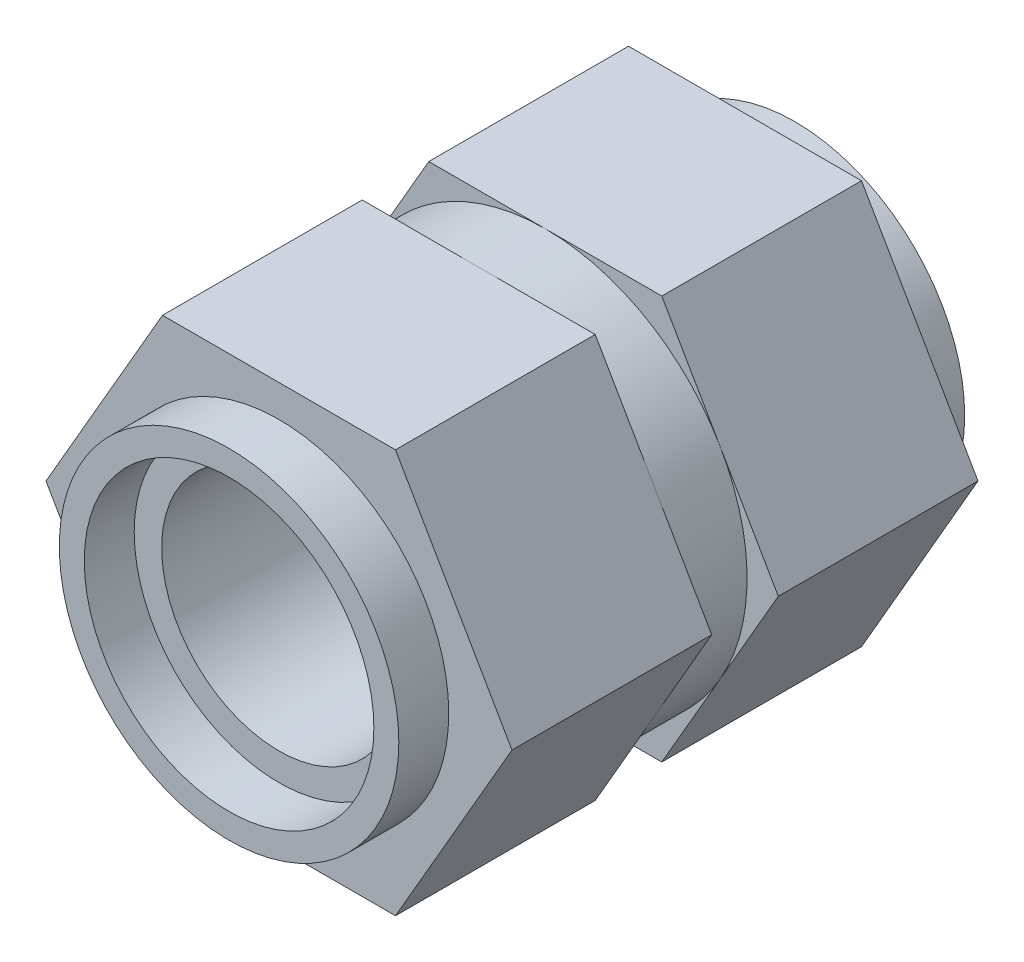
ISO-10303-21;
HEADER;
FILE_DESCRIPTION(('STEP AP214'),'2;1');
FILE_NAME('part.step','',(''),(''),'','','');
FILE_SCHEMA(('AUTOMOTIVE_DESIGN { 1 0 10303 214 1 1 1 1 }'));
ENDSEC;
DATA;
#1=APPLICATION_CONTEXT('core data for automotive mechanical design processes');
#2=APPLICATION_PROTOCOL_DEFINITION('international standard','automotive_design',2000,#1);
#3=PRODUCT_CONTEXT('',#1,'mechanical');
#4=PRODUCT('Part','Part','',(#3));
#5=PRODUCT_RELATED_PRODUCT_CATEGORY('part','',(#4));
#6=PRODUCT_DEFINITION_FORMATION('','',#4);
#7=PRODUCT_DEFINITION_CONTEXT('part definition',#1,'design');
#8=PRODUCT_DEFINITION('design','',#6,#7);
#9=PRODUCT_DEFINITION_SHAPE('','',#8);
#10=(LENGTH_UNIT() NAMED_UNIT(*) SI_UNIT(.MILLI.,.METRE.));
#11=(NAMED_UNIT(*) PLANE_ANGLE_UNIT() SI_UNIT($,.RADIAN.));
#12=(NAMED_UNIT(*) SI_UNIT($,.STERADIAN.) SOLID_ANGLE_UNIT());
#13=UNCERTAINTY_MEASURE_WITH_UNIT(LENGTH_MEASURE(1.E-05),#10,'distance_accuracy_value','');
#14=(GEOMETRIC_REPRESENTATION_CONTEXT(3) GLOBAL_UNCERTAINTY_ASSIGNED_CONTEXT((#13)) GLOBAL_UNIT_ASSIGNED_CONTEXT((#10,
#11,#12)) REPRESENTATION_CONTEXT('',''));
#15=CARTESIAN_POINT('',(0.,0.,0.));
#16=DIRECTION('',(0.,0.,1.));
#17=DIRECTION('',(1.,0.,0.));
#18=AXIS2_PLACEMENT_3D('',#15,#16,#17);
#19=CARTESIAN_POINT('',(0.,0.,14.));
#20=DIRECTION('',(0.,0.,1.));
#21=DIRECTION('',(1.,0.,0.));
#22=AXIS2_PLACEMENT_3D('',#19,#20,#21);
#23=PLANE('',#22);
#24=DIRECTION('',(0.499999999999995,0.866025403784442,0.));
#25=VECTOR('',#24,1.);
#26=CARTESIAN_POINT('',(3.50000000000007,-6.06217782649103,14.));
#27=LINE('',#26,#25);
#28=CARTESIAN_POINT('',(3.50000000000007,-6.06217782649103,14.));
#29=VERTEX_POINT('',#28);
#30=CARTESIAN_POINT('',(7.,0.,14.));
#31=VERTEX_POINT('',#30);
#32=EDGE_CURVE('E168',#29,#31,#27,.T.);
#33=ORIENTED_EDGE('',*,*,#32,.T.);
#34=DIRECTION('',(-0.500000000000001,0.866025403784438,0.));
#35=VECTOR('',#34,1.);
#36=CARTESIAN_POINT('',(7.,0.,14.));
#37=LINE('',#36,#35);
#38=CARTESIAN_POINT('',(3.49999999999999,6.06217782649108,14.));
#39=VERTEX_POINT('',#38);
#40=EDGE_CURVE('E157',#31,#39,#37,.T.);
#41=ORIENTED_EDGE('',*,*,#40,.T.);
#42=DIRECTION('',(-1.,0.,0.));
#43=VECTOR('',#42,1.);
#44=CARTESIAN_POINT('',(3.49999999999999,6.06217782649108,14.));
#45=LINE('',#44,#43);
#46=CARTESIAN_POINT('',(-3.50000000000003,6.06217782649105,14.));
#47=VERTEX_POINT('',#46);
#48=EDGE_CURVE('E167',#39,#47,#45,.T.);
#49=ORIENTED_EDGE('',*,*,#48,.T.);
#50=DIRECTION('',(-0.499999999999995,-0.866025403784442,0.));
#51=VECTOR('',#50,1.);
#52=CARTESIAN_POINT('',(-3.50000000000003,6.06217782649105,14.));
#53=LINE('',#52,#51);
#54=CARTESIAN_POINT('',(-7.,0.,14.));
#55=VERTEX_POINT('',#54);
#56=EDGE_CURVE('E359',#47,#55,#53,.T.);
#57=ORIENTED_EDGE('',*,*,#56,.T.);
#58=DIRECTION('',(0.500000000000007,-0.866025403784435,0.));
#59=VECTOR('',#58,1.);
#60=CARTESIAN_POINT('',(-7.,0.,14.));
#61=LINE('',#60,#59);
#62=CARTESIAN_POINT('',(-3.49999999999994,-6.0621778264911,14.));
#63=VERTEX_POINT('',#62);
#64=EDGE_CURVE('E361',#55,#63,#61,.T.);
#65=ORIENTED_EDGE('',*,*,#64,.T.);
#66=DIRECTION('',(1.,0.,0.));
#67=VECTOR('',#66,1.);
#68=CARTESIAN_POINT('',(-3.49999999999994,-6.0621778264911,14.));
#69=LINE('',#68,#67);
#70=EDGE_CURVE('E173',#63,#29,#69,.T.);
#71=ORIENTED_EDGE('',*,*,#70,.T.);
#72=EDGE_LOOP('',(#33,#41,#49,#57,#65,#71));
#73=FACE_BOUND('',#72,.T.);
#74=CARTESIAN_POINT('',(0.,0.,14.));
#75=DIRECTION('',(0.,0.,1.));
#76=DIRECTION('',(1.,0.,0.));
#77=AXIS2_PLACEMENT_3D('',#74,#75,#76);
#78=CIRCLE('',#77,5.1);
#79=CARTESIAN_POINT('',(5.1,0.,14.));
#80=VERTEX_POINT('',#79);
#81=EDGE_CURVE('E719',#80,#80,#78,.T.);
#82=ORIENTED_EDGE('',*,*,#81,.F.);
#83=EDGE_LOOP('',(#82));
#84=FACE_BOUND('',#83,.T.);
#85=ADVANCED_FACE('F34',(#73,#84),#23,.T.);
#86=CARTESIAN_POINT('',(0.,0.,0.));
#87=DIRECTION('',(0.,0.,1.));
#88=DIRECTION('',(1.,0.,0.));
#89=AXIS2_PLACEMENT_3D('',#86,#87,#88);
#90=PLANE('',#89);
#91=DIRECTION('',(0.499999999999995,0.866025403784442,0.));
#92=VECTOR('',#91,1.);
#93=CARTESIAN_POINT('',(3.50000000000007,-6.06217782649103,0.));
#94=LINE('',#93,#92);
#95=CARTESIAN_POINT('',(3.50000000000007,-6.06217782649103,0.));
#96=VERTEX_POINT('',#95);
#97=CARTESIAN_POINT('',(7.,0.,0.));
#98=VERTEX_POINT('',#97);
#99=EDGE_CURVE('E196',#96,#98,#94,.T.);
#100=ORIENTED_EDGE('',*,*,#99,.F.);
#101=DIRECTION('',(1.,0.,0.));
#102=VECTOR('',#101,1.);
#103=CARTESIAN_POINT('',(-3.49999999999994,-6.0621778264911,0.));
#104=LINE('',#103,#102);
#105=CARTESIAN_POINT('',(-3.49999999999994,-6.0621778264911,0.));
#106=VERTEX_POINT('',#105);
#107=EDGE_CURVE('E233',#106,#96,#104,.T.);
#108=ORIENTED_EDGE('',*,*,#107,.F.);
#109=DIRECTION('',(0.500000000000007,-0.866025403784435,0.));
#110=VECTOR('',#109,1.);
#111=CARTESIAN_POINT('',(-7.,0.,0.));
#112=LINE('',#111,#110);
#113=CARTESIAN_POINT('',(-7.,0.,0.));
#114=VERTEX_POINT('',#113);
#115=EDGE_CURVE('E231',#114,#106,#112,.T.);
#116=ORIENTED_EDGE('',*,*,#115,.F.);
#117=DIRECTION('',(-0.499999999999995,-0.866025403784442,0.));
#118=VECTOR('',#117,1.);
#119=CARTESIAN_POINT('',(-3.50000000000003,6.06217782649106,0.));
#120=LINE('',#119,#118);
#121=CARTESIAN_POINT('',(-3.50000000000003,6.06217782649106,0.));
#122=VERTEX_POINT('',#121);
#123=EDGE_CURVE('E229',#122,#114,#120,.T.);
#124=ORIENTED_EDGE('',*,*,#123,.F.);
#125=DIRECTION('',(-1.,0.,0.));
#126=VECTOR('',#125,1.);
#127=CARTESIAN_POINT('',(3.49999999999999,6.06217782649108,0.));
#128=LINE('',#127,#126);
#129=CARTESIAN_POINT('',(3.49999999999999,6.06217782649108,0.));
#130=VERTEX_POINT('',#129);
#131=EDGE_CURVE('E227',#130,#122,#128,.T.);
#132=ORIENTED_EDGE('',*,*,#131,.F.);
#133=DIRECTION('',(-0.500000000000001,0.866025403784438,0.));
#134=VECTOR('',#133,1.);
#135=CARTESIAN_POINT('',(7.,0.,0.));
#136=LINE('',#135,#134);
#137=EDGE_CURVE('E225',#98,#130,#136,.T.);
#138=ORIENTED_EDGE('',*,*,#137,.F.);
#139=EDGE_LOOP('',(#100,#108,#116,#124,#132,#138));
#140=FACE_BOUND('',#139,.T.);
#141=CARTESIAN_POINT('',(0.,0.,0.));
#142=DIRECTION('',(0.,0.,1.));
#143=DIRECTION('',(1.,0.,0.));
#144=AXIS2_PLACEMENT_3D('',#141,#142,#143);
#145=CIRCLE('',#144,5.1);
#146=CARTESIAN_POINT('',(5.1,0.,0.));
#147=VERTEX_POINT('',#146);
#148=EDGE_CURVE('E42',#147,#147,#145,.F.);
#149=ORIENTED_EDGE('',*,*,#148,.F.);
#150=EDGE_LOOP('',(#149));
#151=FACE_BOUND('',#150,.T.);
#152=ADVANCED_FACE('F283',(#140,#151),#90,.F.);
#153=CARTESIAN_POINT('',(0.,0.,6.));
#154=DIRECTION('',(0.,0.,1.));
#155=DIRECTION('',(1.,0.,0.));
#156=AXIS2_PLACEMENT_3D('',#153,#154,#155);
#157=PLANE('',#156);
#158=CARTESIAN_POINT('',(0.,0.,6.));
#159=DIRECTION('',(0.,0.,1.));
#160=DIRECTION('',(1.,0.,0.));
#161=AXIS2_PLACEMENT_3D('',#158,#159,#160);
#162=CIRCLE('',#161,6.06217881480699);
#163=CARTESIAN_POINT('',(5.25000085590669,3.0310894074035,6.));
#164=VERTEX_POINT('',#163);
#165=CARTESIAN_POINT('',(0.,6.06217782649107,6.));
#166=VERTEX_POINT('',#165);
#167=EDGE_CURVE('E184',#164,#166,#162,.T.);
#168=ORIENTED_EDGE('',*,*,#167,.F.);
#169=DIRECTION('',(-0.500000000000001,0.866025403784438,0.));
#170=VECTOR('',#169,1.);
#171=CARTESIAN_POINT('',(7.,0.,6.));
#172=LINE('',#171,#170);
#173=CARTESIAN_POINT('',(3.49999999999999,6.06217782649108,6.));
#174=VERTEX_POINT('',#173);
#175=EDGE_CURVE('E202',#164,#174,#172,.T.);
#176=ORIENTED_EDGE('',*,*,#175,.T.);
#177=DIRECTION('',(-1.,0.,0.));
#178=VECTOR('',#177,1.);
#179=CARTESIAN_POINT('',(3.49999999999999,6.06217782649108,6.));
#180=LINE('',#179,#178);
#181=EDGE_CURVE('E207',#174,#166,#180,.T.);
#182=ORIENTED_EDGE('',*,*,#181,.T.);
#183=EDGE_LOOP('',(#168,#176,#182));
#184=FACE_BOUND('',#183,.T.);
#185=ADVANCED_FACE('F293',(#184),#157,.T.);
#186=CARTESIAN_POINT('',(-5.25000000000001,3.0310889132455,6.));
#187=VERTEX_POINT('',#186);
#188=EDGE_CURVE('E188',#166,#187,#162,.T.);
#189=ORIENTED_EDGE('',*,*,#188,.F.);
#190=CARTESIAN_POINT('',(-3.50000000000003,6.06217782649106,6.));
#191=VERTEX_POINT('',#190);
#192=EDGE_CURVE('E206',#166,#191,#180,.T.);
#193=ORIENTED_EDGE('',*,*,#192,.T.);
#194=DIRECTION('',(-0.499999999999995,-0.866025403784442,0.));
#195=VECTOR('',#194,1.);
#196=CARTESIAN_POINT('',(-3.50000000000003,6.06217782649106,6.));
#197=LINE('',#196,#195);
#198=EDGE_CURVE('E211',#191,#187,#197,.T.);
#199=ORIENTED_EDGE('',*,*,#198,.T.);
#200=EDGE_LOOP('',(#189,#193,#199));
#201=FACE_BOUND('',#200,.T.);
#202=ADVANCED_FACE('F300',(#201),#157,.T.);
#203=CARTESIAN_POINT('',(-5.24999999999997,-3.03108891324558,6.));
#204=VERTEX_POINT('',#203);
#205=EDGE_CURVE('E255',#187,#204,#162,.T.);
#206=ORIENTED_EDGE('',*,*,#205,.F.);
#207=CARTESIAN_POINT('',(-7.,0.,6.));
#208=VERTEX_POINT('',#207);
#209=EDGE_CURVE('E210',#187,#208,#197,.T.);
#210=ORIENTED_EDGE('',*,*,#209,.T.);
#211=DIRECTION('',(0.500000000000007,-0.866025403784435,0.));
#212=VECTOR('',#211,1.);
#213=CARTESIAN_POINT('',(-7.,0.,6.));
#214=LINE('',#213,#212);
#215=EDGE_CURVE('E215',#208,#204,#214,.T.);
#216=ORIENTED_EDGE('',*,*,#215,.T.);
#217=EDGE_LOOP('',(#206,#210,#216));
#218=FACE_BOUND('',#217,.T.);
#219=ADVANCED_FACE('F307',(#218),#157,.T.);
#220=CARTESIAN_POINT('',(0.,-6.06217782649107,6.));
#221=VERTEX_POINT('',#220);
#222=EDGE_CURVE('E258',#204,#221,#162,.T.);
#223=ORIENTED_EDGE('',*,*,#222,.F.);
#224=CARTESIAN_POINT('',(-3.49999999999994,-6.0621778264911,6.));
#225=VERTEX_POINT('',#224);
#226=EDGE_CURVE('E214',#204,#225,#214,.T.);
#227=ORIENTED_EDGE('',*,*,#226,.T.);
#228=DIRECTION('',(1.,0.,0.));
#229=VECTOR('',#228,1.);
#230=CARTESIAN_POINT('',(-3.49999999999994,-6.0621778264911,6.));
#231=LINE('',#230,#229);
#232=EDGE_CURVE('E219',#225,#221,#231,.T.);
#233=ORIENTED_EDGE('',*,*,#232,.T.);
#234=EDGE_LOOP('',(#223,#227,#233));
#235=FACE_BOUND('',#234,.T.);
#236=ADVANCED_FACE('F313',(#235),#157,.T.);
#237=CARTESIAN_POINT('',(5.25000000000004,-3.03108891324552,6.));
#238=VERTEX_POINT('',#237);
#239=EDGE_CURVE('E260',#221,#238,#162,.T.);
#240=ORIENTED_EDGE('',*,*,#239,.F.);
#241=CARTESIAN_POINT('',(3.50000000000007,-6.06217782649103,6.));
#242=VERTEX_POINT('',#241);
#243=EDGE_CURVE('E218',#221,#242,#231,.T.);
#244=ORIENTED_EDGE('',*,*,#243,.T.);
#245=DIRECTION('',(0.499999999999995,0.866025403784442,0.));
#246=VECTOR('',#245,1.);
#247=CARTESIAN_POINT('',(3.50000000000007,-6.06217782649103,6.));
#248=LINE('',#247,#246);
#249=EDGE_CURVE('E199',#242,#238,#248,.T.);
#250=ORIENTED_EDGE('',*,*,#249,.T.);
#251=EDGE_LOOP('',(#240,#244,#250));
#252=FACE_BOUND('',#251,.T.);
#253=ADVANCED_FACE('F274',(#252),#157,.T.);
#254=CARTESIAN_POINT('',(3.50000000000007,-6.06217782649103,6.));
#255=DIRECTION('',(-0.866025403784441,0.499999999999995,0.));
#256=DIRECTION('',(-0.499999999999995,-0.866025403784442,0.));
#257=AXIS2_PLACEMENT_3D('',#254,#255,#256);
#258=PLANE('',#257);
#259=ORIENTED_EDGE('',*,*,#99,.T.);
#260=DIRECTION('',(0.,0.,-1.));
#261=VECTOR('',#260,1.);
#262=CARTESIAN_POINT('',(7.,0.,6.));
#263=LINE('',#262,#261);
#264=CARTESIAN_POINT('',(7.,0.,6.));
#265=VERTEX_POINT('',#264);
#266=EDGE_CURVE('E249',#265,#98,#263,.T.);
#267=ORIENTED_EDGE('',*,*,#266,.F.);
#268=EDGE_CURVE('E203',#238,#265,#248,.T.);
#269=ORIENTED_EDGE('',*,*,#268,.F.);
#270=ORIENTED_EDGE('',*,*,#249,.F.);
#271=DIRECTION('',(0.,0.,-1.));
#272=VECTOR('',#271,1.);
#273=CARTESIAN_POINT('',(3.50000000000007,-6.06217782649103,6.));
#274=LINE('',#273,#272);
#275=EDGE_CURVE('E222',#242,#96,#274,.T.);
#276=ORIENTED_EDGE('',*,*,#275,.T.);
#277=EDGE_LOOP('',(#259,#267,#269,#270,#276));
#278=FACE_BOUND('',#277,.T.);
#279=ADVANCED_FACE('F36',(#278),#258,.F.);
#280=CARTESIAN_POINT('',(7.,0.,6.));
#281=DIRECTION('',(-0.866025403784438,-0.500000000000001,0.));
#282=DIRECTION('',(0.500000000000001,-0.866025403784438,0.));
#283=AXIS2_PLACEMENT_3D('',#280,#281,#282);
#284=PLANE('',#283);
#285=ORIENTED_EDGE('',*,*,#137,.T.);
#286=DIRECTION('',(0.,0.,-1.));
#287=VECTOR('',#286,1.);
#288=CARTESIAN_POINT('',(3.49999999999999,6.06217782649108,6.));
#289=LINE('',#288,#287);
#290=EDGE_CURVE('E246',#174,#130,#289,.T.);
#291=ORIENTED_EDGE('',*,*,#290,.F.);
#292=ORIENTED_EDGE('',*,*,#175,.F.);
#293=EDGE_CURVE('E204',#265,#164,#172,.T.);
#294=ORIENTED_EDGE('',*,*,#293,.F.);
#295=ORIENTED_EDGE('',*,*,#266,.T.);
#296=EDGE_LOOP('',(#285,#291,#292,#294,#295));
#297=FACE_BOUND('',#296,.T.);
#298=ADVANCED_FACE('F290',(#297),#284,.F.);
#299=CARTESIAN_POINT('',(3.49999999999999,6.06217782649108,6.));
#300=DIRECTION('',(0.,-1.,0.));
#301=DIRECTION('',(1.,0.,0.));
#302=AXIS2_PLACEMENT_3D('',#299,#300,#301);
#303=PLANE('',#302);
#304=ORIENTED_EDGE('',*,*,#131,.T.);
#305=DIRECTION('',(0.,0.,-1.));
#306=VECTOR('',#305,1.);
#307=CARTESIAN_POINT('',(-3.50000000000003,6.06217782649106,6.));
#308=LINE('',#307,#306);
#309=EDGE_CURVE('E243',#191,#122,#308,.T.);
#310=ORIENTED_EDGE('',*,*,#309,.F.);
#311=ORIENTED_EDGE('',*,*,#192,.F.);
#312=ORIENTED_EDGE('',*,*,#181,.F.);
#313=ORIENTED_EDGE('',*,*,#290,.T.);
#314=EDGE_LOOP('',(#304,#310,#311,#312,#313));
#315=FACE_BOUND('',#314,.T.);
#316=ADVANCED_FACE('F296',(#315),#303,.F.);
#317=CARTESIAN_POINT('',(-3.50000000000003,6.06217782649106,6.));
#318=DIRECTION('',(0.866025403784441,-0.499999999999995,0.));
#319=DIRECTION('',(0.499999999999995,0.866025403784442,0.));
#320=AXIS2_PLACEMENT_3D('',#317,#318,#319);
#321=PLANE('',#320);
#322=ORIENTED_EDGE('',*,*,#123,.T.);
#323=DIRECTION('',(0.,0.,-1.));
#324=VECTOR('',#323,1.);
#325=CARTESIAN_POINT('',(-7.,0.,6.));
#326=LINE('',#325,#324);
#327=EDGE_CURVE('E240',#208,#114,#326,.T.);
#328=ORIENTED_EDGE('',*,*,#327,.F.);
#329=ORIENTED_EDGE('',*,*,#209,.F.);
#330=ORIENTED_EDGE('',*,*,#198,.F.);
#331=ORIENTED_EDGE('',*,*,#309,.T.);
#332=EDGE_LOOP('',(#322,#328,#329,#330,#331));
#333=FACE_BOUND('',#332,.T.);
#334=ADVANCED_FACE('F303',(#333),#321,.F.);
#335=CARTESIAN_POINT('',(-7.,0.,6.));
#336=DIRECTION('',(0.866025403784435,0.500000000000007,0.));
#337=DIRECTION('',(-0.500000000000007,0.866025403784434,0.));
#338=AXIS2_PLACEMENT_3D('',#335,#336,#337);
#339=PLANE('',#338);
#340=ORIENTED_EDGE('',*,*,#115,.T.);
#341=DIRECTION('',(0.,0.,-1.));
#342=VECTOR('',#341,1.);
#343=CARTESIAN_POINT('',(-3.49999999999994,-6.0621778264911,6.));
#344=LINE('',#343,#342);
#345=EDGE_CURVE('E237',#225,#106,#344,.T.);
#346=ORIENTED_EDGE('',*,*,#345,.F.);
#347=ORIENTED_EDGE('',*,*,#226,.F.);
#348=ORIENTED_EDGE('',*,*,#215,.F.);
#349=ORIENTED_EDGE('',*,*,#327,.T.);
#350=EDGE_LOOP('',(#340,#346,#347,#348,#349));
#351=FACE_BOUND('',#350,.T.);
#352=ADVANCED_FACE('F310',(#351),#339,.F.);
#353=CARTESIAN_POINT('',(-3.49999999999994,-6.0621778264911,6.));
#354=DIRECTION('',(0.,1.,0.));
#355=DIRECTION('',(-1.,0.,0.));
#356=AXIS2_PLACEMENT_3D('',#353,#354,#355);
#357=PLANE('',#356);
#358=ORIENTED_EDGE('',*,*,#107,.T.);
#359=ORIENTED_EDGE('',*,*,#275,.F.);
#360=ORIENTED_EDGE('',*,*,#243,.F.);
#361=ORIENTED_EDGE('',*,*,#232,.F.);
#362=ORIENTED_EDGE('',*,*,#345,.T.);
#363=EDGE_LOOP('',(#358,#359,#360,#361,#362));
#364=FACE_BOUND('',#363,.T.);
#365=ADVANCED_FACE('F279',(#364),#357,.F.);
#366=EDGE_CURVE('E189',#238,#164,#162,.T.);
#367=ORIENTED_EDGE('',*,*,#366,.F.);
#368=ORIENTED_EDGE('',*,*,#268,.T.);
#369=ORIENTED_EDGE('',*,*,#293,.T.);
#370=EDGE_LOOP('',(#367,#368,#369));
#371=FACE_BOUND('',#370,.T.);
#372=ADVANCED_FACE('F267',(#371),#157,.T.);
#373=CARTESIAN_POINT('',(0.,0.,8.));
#374=DIRECTION('',(0.,0.,-1.));
#375=DIRECTION('',(-1.,0.,0.));
#376=AXIS2_PLACEMENT_3D('',#373,#374,#375);
#377=CYLINDRICAL_SURFACE('',#376,6.06217881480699);
#378=CARTESIAN_POINT('',(0.,0.,8.));
#379=DIRECTION('',(0.,0.,1.));
#380=DIRECTION('',(1.,0.,0.));
#381=AXIS2_PLACEMENT_3D('',#378,#379,#380);
#382=CIRCLE('',#381,6.06217881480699);
#383=CARTESIAN_POINT('',(5.24999999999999,3.03108891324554,8.));
#384=VERTEX_POINT('',#383);
#385=CARTESIAN_POINT('',(0.,6.06217782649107,8.));
#386=VERTEX_POINT('',#385);
#387=EDGE_CURVE('E194',#384,#386,#382,.T.);
#388=ORIENTED_EDGE('',*,*,#387,.F.);
#389=CARTESIAN_POINT('',(5.25000000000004,-3.03108891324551,8.));
#390=VERTEX_POINT('',#389);
#391=EDGE_CURVE('E49',#390,#384,#382,.T.);
#392=ORIENTED_EDGE('',*,*,#391,.F.);
#393=CARTESIAN_POINT('',(0.,-6.06217782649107,8.));
#394=VERTEX_POINT('',#393);
#395=EDGE_CURVE('E53',#394,#390,#382,.T.);
#396=ORIENTED_EDGE('',*,*,#395,.F.);
#397=CARTESIAN_POINT('',(-5.24999999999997,-3.03108891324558,8.));
#398=VERTEX_POINT('',#397);
#399=EDGE_CURVE('E421',#398,#394,#382,.T.);
#400=ORIENTED_EDGE('',*,*,#399,.F.);
#401=CARTESIAN_POINT('',(-5.25000000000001,3.0310889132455,8.));
#402=VERTEX_POINT('',#401);
#403=EDGE_CURVE('E404',#402,#398,#382,.T.);
#404=ORIENTED_EDGE('',*,*,#403,.F.);
#405=EDGE_CURVE('E197',#386,#402,#382,.T.);
#406=ORIENTED_EDGE('',*,*,#405,.F.);
#407=EDGE_LOOP('',(#388,#392,#396,#400,#404,#406));
#408=FACE_BOUND('',#407,.T.);
#409=ORIENTED_EDGE('',*,*,#167,.T.);
#410=ORIENTED_EDGE('',*,*,#188,.T.);
#411=ORIENTED_EDGE('',*,*,#205,.T.);
#412=ORIENTED_EDGE('',*,*,#222,.T.);
#413=ORIENTED_EDGE('',*,*,#239,.T.);
#414=ORIENTED_EDGE('',*,*,#366,.T.);
#415=EDGE_LOOP('',(#409,#410,#411,#412,#413,#414));
#416=FACE_BOUND('',#415,.T.);
#417=ADVANCED_FACE('F263',(#408,#416),#377,.T.);
#418=CARTESIAN_POINT('',(0.,0.,8.));
#419=DIRECTION('',(0.,0.,1.));
#420=DIRECTION('',(1.,0.,0.));
#421=AXIS2_PLACEMENT_3D('',#418,#419,#420);
#422=PLANE('',#421);
#423=DIRECTION('',(-0.500000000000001,0.866025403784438,0.));
#424=VECTOR('',#423,1.);
#425=CARTESIAN_POINT('',(7.,0.,8.));
#426=LINE('',#425,#424);
#427=CARTESIAN_POINT('',(3.49999999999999,6.06217782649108,8.));
#428=VERTEX_POINT('',#427);
#429=EDGE_CURVE('E367',#384,#428,#426,.T.);
#430=ORIENTED_EDGE('',*,*,#429,.F.);
#431=ORIENTED_EDGE('',*,*,#387,.T.);
#432=DIRECTION('',(-1.,0.,0.));
#433=VECTOR('',#432,1.);
#434=CARTESIAN_POINT('',(3.49999999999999,6.06217782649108,8.));
#435=LINE('',#434,#433);
#436=EDGE_CURVE('E371',#428,#386,#435,.T.);
#437=ORIENTED_EDGE('',*,*,#436,.F.);
#438=EDGE_LOOP('',(#430,#431,#437));
#439=FACE_BOUND('',#438,.T.);
#440=ADVANCED_FACE('F418',(#439),#422,.F.);
#441=CARTESIAN_POINT('',(-3.50000000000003,6.06217782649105,8.));
#442=VERTEX_POINT('',#441);
#443=EDGE_CURVE('E370',#386,#442,#435,.T.);
#444=ORIENTED_EDGE('',*,*,#443,.F.);
#445=ORIENTED_EDGE('',*,*,#405,.T.);
#446=DIRECTION('',(-0.499999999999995,-0.866025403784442,0.));
#447=VECTOR('',#446,1.);
#448=CARTESIAN_POINT('',(-3.50000000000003,6.06217782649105,8.));
#449=LINE('',#448,#447);
#450=EDGE_CURVE('E375',#442,#402,#449,.T.);
#451=ORIENTED_EDGE('',*,*,#450,.F.);
#452=EDGE_LOOP('',(#444,#445,#451));
#453=FACE_BOUND('',#452,.T.);
#454=ADVANCED_FACE('F402',(#453),#422,.F.);
#455=CARTESIAN_POINT('',(-7.,0.,8.));
#456=VERTEX_POINT('',#455);
#457=EDGE_CURVE('E374',#402,#456,#449,.T.);
#458=ORIENTED_EDGE('',*,*,#457,.F.);
#459=ORIENTED_EDGE('',*,*,#403,.T.);
#460=DIRECTION('',(0.500000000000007,-0.866025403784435,0.));
#461=VECTOR('',#460,1.);
#462=CARTESIAN_POINT('',(-7.,0.,8.));
#463=LINE('',#462,#461);
#464=EDGE_CURVE('E379',#456,#398,#463,.T.);
#465=ORIENTED_EDGE('',*,*,#464,.F.);
#466=EDGE_LOOP('',(#458,#459,#465));
#467=FACE_BOUND('',#466,.T.);
#468=ADVANCED_FACE('F408',(#467),#422,.F.);
#469=CARTESIAN_POINT('',(-3.49999999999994,-6.0621778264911,8.));
#470=VERTEX_POINT('',#469);
#471=EDGE_CURVE('E378',#398,#470,#463,.T.);
#472=ORIENTED_EDGE('',*,*,#471,.F.);
#473=ORIENTED_EDGE('',*,*,#399,.T.);
#474=DIRECTION('',(1.,0.,0.));
#475=VECTOR('',#474,1.);
#476=CARTESIAN_POINT('',(-3.49999999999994,-6.0621778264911,8.));
#477=LINE('',#476,#475);
#478=EDGE_CURVE('E177',#470,#394,#477,.T.);
#479=ORIENTED_EDGE('',*,*,#478,.F.);
#480=EDGE_LOOP('',(#472,#473,#479));
#481=FACE_BOUND('',#480,.T.);
#482=ADVANCED_FACE('F427',(#481),#422,.F.);
#483=CARTESIAN_POINT('',(3.50000000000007,-6.06217782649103,8.));
#484=VERTEX_POINT('',#483);
#485=EDGE_CURVE('E382',#394,#484,#477,.T.);
#486=ORIENTED_EDGE('',*,*,#485,.F.);
#487=ORIENTED_EDGE('',*,*,#395,.T.);
#488=DIRECTION('',(0.499999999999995,0.866025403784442,0.));
#489=VECTOR('',#488,1.);
#490=CARTESIAN_POINT('',(3.50000000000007,-6.06217782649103,8.));
#491=LINE('',#490,#489);
#492=EDGE_CURVE('E365',#484,#390,#491,.T.);
#493=ORIENTED_EDGE('',*,*,#492,.F.);
#494=EDGE_LOOP('',(#486,#487,#493));
#495=FACE_BOUND('',#494,.T.);
#496=ADVANCED_FACE('F428',(#495),#422,.F.);
#497=CARTESIAN_POINT('',(7.,0.,8.));
#498=VERTEX_POINT('',#497);
#499=EDGE_CURVE('E182',#390,#498,#491,.T.);
#500=ORIENTED_EDGE('',*,*,#499,.F.);
#501=ORIENTED_EDGE('',*,*,#391,.T.);
#502=EDGE_CURVE('E368',#498,#384,#426,.T.);
#503=ORIENTED_EDGE('',*,*,#502,.F.);
#504=EDGE_LOOP('',(#500,#501,#503));
#505=FACE_BOUND('',#504,.T.);
#506=ADVANCED_FACE('F420',(#505),#422,.F.);
#507=CARTESIAN_POINT('',(3.50000000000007,-6.06217782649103,14.));
#508=DIRECTION('',(-0.866025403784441,0.499999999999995,0.));
#509=DIRECTION('',(-0.499999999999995,-0.866025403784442,0.));
#510=AXIS2_PLACEMENT_3D('',#507,#508,#509);
#511=PLANE('',#510);
#512=ORIENTED_EDGE('',*,*,#492,.T.);
#513=ORIENTED_EDGE('',*,*,#499,.T.);
#514=DIRECTION('',(0.,0.,-1.));
#515=VECTOR('',#514,1.);
#516=CARTESIAN_POINT('',(7.,0.,14.));
#517=LINE('',#516,#515);
#518=EDGE_CURVE('E162',#31,#498,#517,.T.);
#519=ORIENTED_EDGE('',*,*,#518,.F.);
#520=ORIENTED_EDGE('',*,*,#32,.F.);
#521=DIRECTION('',(0.,0.,-1.));
#522=VECTOR('',#521,1.);
#523=CARTESIAN_POINT('',(3.50000000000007,-6.06217782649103,14.));
#524=LINE('',#523,#522);
#525=EDGE_CURVE('E364',#29,#484,#524,.T.);
#526=ORIENTED_EDGE('',*,*,#525,.T.);
#527=EDGE_LOOP('',(#512,#513,#519,#520,#526));
#528=FACE_BOUND('',#527,.T.);
#529=ADVANCED_FACE('F180',(#528),#511,.F.);
#530=CARTESIAN_POINT('',(7.,0.,14.));
#531=DIRECTION('',(-0.866025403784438,-0.500000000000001,0.));
#532=DIRECTION('',(0.500000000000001,-0.866025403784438,0.));
#533=AXIS2_PLACEMENT_3D('',#530,#531,#532);
#534=PLANE('',#533);
#535=ORIENTED_EDGE('',*,*,#502,.T.);
#536=ORIENTED_EDGE('',*,*,#429,.T.);
#537=DIRECTION('',(0.,0.,-1.));
#538=VECTOR('',#537,1.);
#539=CARTESIAN_POINT('',(3.49999999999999,6.06217782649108,14.));
#540=LINE('',#539,#538);
#541=EDGE_CURVE('E164',#39,#428,#540,.T.);
#542=ORIENTED_EDGE('',*,*,#541,.F.);
#543=ORIENTED_EDGE('',*,*,#40,.F.);
#544=ORIENTED_EDGE('',*,*,#518,.T.);
#545=EDGE_LOOP('',(#535,#536,#542,#543,#544));
#546=FACE_BOUND('',#545,.T.);
#547=ADVANCED_FACE('F160',(#546),#534,.F.);
#548=CARTESIAN_POINT('',(3.49999999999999,6.06217782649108,14.));
#549=DIRECTION('',(0.,-1.,0.));
#550=DIRECTION('',(1.,0.,0.));
#551=AXIS2_PLACEMENT_3D('',#548,#549,#550);
#552=PLANE('',#551);
#553=ORIENTED_EDGE('',*,*,#436,.T.);
#554=ORIENTED_EDGE('',*,*,#443,.T.);
#555=DIRECTION('',(0.,0.,-1.));
#556=VECTOR('',#555,1.);
#557=CARTESIAN_POINT('',(-3.50000000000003,6.06217782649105,14.));
#558=LINE('',#557,#556);
#559=EDGE_CURVE('E190',#47,#442,#558,.T.);
#560=ORIENTED_EDGE('',*,*,#559,.F.);
#561=ORIENTED_EDGE('',*,*,#48,.F.);
#562=ORIENTED_EDGE('',*,*,#541,.T.);
#563=EDGE_LOOP('',(#553,#554,#560,#561,#562));
#564=FACE_BOUND('',#563,.T.);
#565=ADVANCED_FACE('F414',(#564),#552,.F.);
#566=CARTESIAN_POINT('',(-3.50000000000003,6.06217782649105,14.));
#567=DIRECTION('',(0.866025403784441,-0.499999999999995,0.));
#568=DIRECTION('',(0.499999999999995,0.866025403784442,0.));
#569=AXIS2_PLACEMENT_3D('',#566,#567,#568);
#570=PLANE('',#569);
#571=ORIENTED_EDGE('',*,*,#450,.T.);
#572=ORIENTED_EDGE('',*,*,#457,.T.);
#573=DIRECTION('',(0.,0.,-1.));
#574=VECTOR('',#573,1.);
#575=CARTESIAN_POINT('',(-7.,0.,14.));
#576=LINE('',#575,#574);
#577=EDGE_CURVE('E389',#55,#456,#576,.T.);
#578=ORIENTED_EDGE('',*,*,#577,.F.);
#579=ORIENTED_EDGE('',*,*,#56,.F.);
#580=ORIENTED_EDGE('',*,*,#559,.T.);
#581=EDGE_LOOP('',(#571,#572,#578,#579,#580));
#582=FACE_BOUND('',#581,.T.);
#583=ADVANCED_FACE('F396',(#582),#570,.F.);
#584=CARTESIAN_POINT('',(-7.,0.,14.));
#585=DIRECTION('',(0.866025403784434,0.500000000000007,0.));
#586=DIRECTION('',(-0.500000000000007,0.866025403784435,0.));
#587=AXIS2_PLACEMENT_3D('',#584,#585,#586);
#588=PLANE('',#587);
#589=ORIENTED_EDGE('',*,*,#464,.T.);
#590=ORIENTED_EDGE('',*,*,#471,.T.);
#591=DIRECTION('',(0.,0.,-1.));
#592=VECTOR('',#591,1.);
#593=CARTESIAN_POINT('',(-3.49999999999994,-6.0621778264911,14.));
#594=LINE('',#593,#592);
#595=EDGE_CURVE('E386',#63,#470,#594,.T.);
#596=ORIENTED_EDGE('',*,*,#595,.F.);
#597=ORIENTED_EDGE('',*,*,#64,.F.);
#598=ORIENTED_EDGE('',*,*,#577,.T.);
#599=EDGE_LOOP('',(#589,#590,#596,#597,#598));
#600=FACE_BOUND('',#599,.T.);
#601=ADVANCED_FACE('F412',(#600),#588,.F.);
#602=CARTESIAN_POINT('',(-3.49999999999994,-6.0621778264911,14.));
#603=DIRECTION('',(0.,1.,0.));
#604=DIRECTION('',(-1.,0.,0.));
#605=AXIS2_PLACEMENT_3D('',#602,#603,#604);
#606=PLANE('',#605);
#607=ORIENTED_EDGE('',*,*,#478,.T.);
#608=ORIENTED_EDGE('',*,*,#485,.T.);
#609=ORIENTED_EDGE('',*,*,#525,.F.);
#610=ORIENTED_EDGE('',*,*,#70,.F.);
#611=ORIENTED_EDGE('',*,*,#595,.T.);
#612=EDGE_LOOP('',(#607,#608,#609,#610,#611));
#613=FACE_BOUND('',#612,.T.);
#614=ADVANCED_FACE('F430',(#613),#606,.F.);
#615=CARTESIAN_POINT('',(0.,0.,-1.5));
#616=DIRECTION('',(0.,0.,-1.));
#617=DIRECTION('',(-1.,0.,0.));
#618=AXIS2_PLACEMENT_3D('',#615,#616,#617);
#619=PLANE('',#618);
#620=CARTESIAN_POINT('',(0.,0.,-1.5));
#621=DIRECTION('',(0.,0.,-1.));
#622=DIRECTION('',(-1.,0.,0.));
#623=AXIS2_PLACEMENT_3D('',#620,#621,#622);
#624=CIRCLE('',#623,5.1);
#625=CARTESIAN_POINT('',(-5.1,0.,-1.5));
#626=VERTEX_POINT('',#625);
#627=EDGE_CURVE('E350',#626,#626,#624,.T.);
#628=ORIENTED_EDGE('',*,*,#627,.T.);
#629=EDGE_LOOP('',(#628));
#630=FACE_BOUND('',#629,.T.);
#631=CARTESIAN_POINT('',(0.,0.,-1.5));
#632=DIRECTION('',(0.,0.,-1.));
#633=DIRECTION('',(-1.,0.,0.));
#634=AXIS2_PLACEMENT_3D('',#631,#632,#633);
#635=CIRCLE('',#634,4.35);
#636=CARTESIAN_POINT('',(-4.35,0.,-1.5));
#637=VERTEX_POINT('',#636);
#638=EDGE_CURVE('E355',#637,#637,#635,.T.);
#639=ORIENTED_EDGE('',*,*,#638,.F.);
#640=EDGE_LOOP('',(#639));
#641=FACE_BOUND('',#640,.T.);
#642=ADVANCED_FACE('F432',(#630,#641),#619,.T.);
#643=CARTESIAN_POINT('',(0.,0.,-1.5));
#644=DIRECTION('',(0.,0.,1.));
#645=DIRECTION('',(1.,0.,0.));
#646=AXIS2_PLACEMENT_3D('',#643,#644,#645);
#647=CYLINDRICAL_SURFACE('',#646,5.1);
#648=ORIENTED_EDGE('',*,*,#627,.F.);
#649=EDGE_LOOP('',(#648));
#650=FACE_BOUND('',#649,.T.);
#651=ORIENTED_EDGE('',*,*,#148,.T.);
#652=EDGE_LOOP('',(#651));
#653=FACE_BOUND('',#652,.T.);
#654=ADVANCED_FACE('F438',(#650,#653),#647,.T.);
#655=CARTESIAN_POINT('',(0.,0.,-1.5));
#656=DIRECTION('',(0.,0.,1.));
#657=DIRECTION('',(1.,0.,0.));
#658=AXIS2_PLACEMENT_3D('',#655,#656,#657);
#659=CYLINDRICAL_SURFACE('',#658,4.35);
#660=ORIENTED_EDGE('',*,*,#638,.T.);
#661=EDGE_LOOP('',(#660));
#662=FACE_BOUND('',#661,.T.);
#663=CARTESIAN_POINT('',(0.,0.,0.));
#664=DIRECTION('',(0.,0.,-1.));
#665=DIRECTION('',(-1.,0.,0.));
#666=AXIS2_PLACEMENT_3D('',#663,#664,#665);
#667=CIRCLE('',#666,4.35);
#668=CARTESIAN_POINT('',(-4.35,0.,0.));
#669=VERTEX_POINT('',#668);
#670=EDGE_CURVE('E727',#669,#669,#667,.T.);
#671=ORIENTED_EDGE('',*,*,#670,.F.);
#672=EDGE_LOOP('',(#671));
#673=FACE_BOUND('',#672,.T.);
#674=ADVANCED_FACE('F638',(#662,#673),#659,.F.);
#675=CARTESIAN_POINT('',(0.,0.,0.));
#676=DIRECTION('',(0.,0.,-1.));
#677=DIRECTION('',(-1.,0.,0.));
#678=AXIS2_PLACEMENT_3D('',#675,#676,#677);
#679=CIRCLE('',#678,1.5);
#680=CARTESIAN_POINT('',(-1.5,0.,0.));
#681=VERTEX_POINT('',#680);
#682=EDGE_CURVE('E716',#681,#681,#679,.T.);
#683=ORIENTED_EDGE('',*,*,#682,.F.);
#684=EDGE_LOOP('',(#683));
#685=FACE_BOUND('',#684,.T.);
#686=ORIENTED_EDGE('',*,*,#670,.T.);
#687=EDGE_LOOP('',(#686));
#688=FACE_BOUND('',#687,.T.);
#689=ADVANCED_FACE('F328',(#685,#688),#90,.F.);
#690=CARTESIAN_POINT('',(0.,0.,15.5));
#691=DIRECTION('',(0.,0.,1.));
#692=DIRECTION('',(1.,0.,0.));
#693=AXIS2_PLACEMENT_3D('',#690,#691,#692);
#694=PLANE('',#693);
#695=CARTESIAN_POINT('',(0.,0.,15.5));
#696=DIRECTION('',(0.,0.,1.));
#697=DIRECTION('',(1.,0.,0.));
#698=AXIS2_PLACEMENT_3D('',#695,#696,#697);
#699=CIRCLE('',#698,5.1);
#700=CARTESIAN_POINT('',(5.1,0.,15.5));
#701=VERTEX_POINT('',#700);
#702=EDGE_CURVE('E724',#701,#701,#699,.T.);
#703=ORIENTED_EDGE('',*,*,#702,.T.);
#704=EDGE_LOOP('',(#703));
#705=FACE_BOUND('',#704,.T.);
#706=CARTESIAN_POINT('',(0.,0.,15.5));
#707=DIRECTION('',(0.,0.,1.));
#708=DIRECTION('',(1.,0.,0.));
#709=AXIS2_PLACEMENT_3D('',#706,#707,#708);
#710=CIRCLE('',#709,4.35);
#711=CARTESIAN_POINT('',(4.35,0.,15.5));
#712=VERTEX_POINT('',#711);
#713=EDGE_CURVE('E715',#712,#712,#710,.T.);
#714=ORIENTED_EDGE('',*,*,#713,.F.);
#715=EDGE_LOOP('',(#714));
#716=FACE_BOUND('',#715,.T.);
#717=ADVANCED_FACE('F659',(#705,#716),#694,.T.);
#718=CARTESIAN_POINT('',(0.,0.,15.5));
#719=DIRECTION('',(0.,0.,-1.));
#720=DIRECTION('',(-1.,0.,0.));
#721=AXIS2_PLACEMENT_3D('',#718,#719,#720);
#722=CYLINDRICAL_SURFACE('',#721,5.1);
#723=ORIENTED_EDGE('',*,*,#702,.F.);
#724=EDGE_LOOP('',(#723));
#725=FACE_BOUND('',#724,.T.);
#726=ORIENTED_EDGE('',*,*,#81,.T.);
#727=EDGE_LOOP('',(#726));
#728=FACE_BOUND('',#727,.T.);
#729=ADVANCED_FACE('F663',(#725,#728),#722,.T.);
#730=CARTESIAN_POINT('',(0.,0.,15.5));
#731=DIRECTION('',(0.,0.,-1.));
#732=DIRECTION('',(-1.,0.,0.));
#733=AXIS2_PLACEMENT_3D('',#730,#731,#732);
#734=CYLINDRICAL_SURFACE('',#733,4.35);
#735=ORIENTED_EDGE('',*,*,#713,.T.);
#736=EDGE_LOOP('',(#735));
#737=FACE_BOUND('',#736,.T.);
#738=CARTESIAN_POINT('',(0.,0.,14.));
#739=DIRECTION('',(0.,0.,1.));
#740=DIRECTION('',(1.,0.,0.));
#741=AXIS2_PLACEMENT_3D('',#738,#739,#740);
#742=CIRCLE('',#741,4.35);
#743=CARTESIAN_POINT('',(4.35,0.,14.));
#744=VERTEX_POINT('',#743);
#745=EDGE_CURVE('E11',#744,#744,#742,.F.);
#746=ORIENTED_EDGE('',*,*,#745,.T.);
#747=EDGE_LOOP('',(#746));
#748=FACE_BOUND('',#747,.T.);
#749=ADVANCED_FACE('F673',(#737,#748),#734,.F.);
#750=CARTESIAN_POINT('',(0.,0.,2.5));
#751=DIRECTION('',(0.,0.,1.));
#752=DIRECTION('',(1.,0.,0.));
#753=AXIS2_PLACEMENT_3D('',#750,#751,#752);
#754=PLANE('',#753);
#755=CARTESIAN_POINT('',(0.,0.,2.5));
#756=DIRECTION('',(0.,0.,1.));
#757=DIRECTION('',(1.,0.,0.));
#758=AXIS2_PLACEMENT_3D('',#755,#756,#757);
#759=CIRCLE('',#758,1.5);
#760=CARTESIAN_POINT('',(-1.5,0.,2.5));
#761=VERTEX_POINT('',#760);
#762=EDGE_CURVE('E712',#761,#761,#759,.F.);
#763=ORIENTED_EDGE('',*,*,#762,.T.);
#764=EDGE_LOOP('',(#763));
#765=FACE_BOUND('',#764,.T.);
#766=CARTESIAN_POINT('',(0.,0.,2.5));
#767=DIRECTION('',(0.,0.,1.));
#768=DIRECTION('',(1.,0.,0.));
#769=AXIS2_PLACEMENT_3D('',#766,#767,#768);
#770=CIRCLE('',#769,3.525);
#771=CARTESIAN_POINT('',(3.525,0.,2.5));
#772=VERTEX_POINT('',#771);
#773=EDGE_CURVE('E349',#772,#772,#770,.T.);
#774=ORIENTED_EDGE('',*,*,#773,.T.);
#775=EDGE_LOOP('',(#774));
#776=FACE_BOUND('',#775,.T.);
#777=ADVANCED_FACE('F341',(#765,#776),#754,.T.);
#778=CARTESIAN_POINT('',(0.,0.,2.5));
#779=DIRECTION('',(0.,0.,1.));
#780=DIRECTION('',(1.,0.,0.));
#781=AXIS2_PLACEMENT_3D('',#778,#779,#780);
#782=CYLINDRICAL_SURFACE('',#781,3.525);
#783=ORIENTED_EDGE('',*,*,#773,.F.);
#784=EDGE_LOOP('',(#783));
#785=FACE_BOUND('',#784,.T.);
#786=CARTESIAN_POINT('',(0.,0.,14.));
#787=DIRECTION('',(0.,0.,1.));
#788=DIRECTION('',(1.,0.,0.));
#789=AXIS2_PLACEMENT_3D('',#786,#787,#788);
#790=CIRCLE('',#789,3.525);
#791=CARTESIAN_POINT('',(3.525,0.,14.));
#792=VERTEX_POINT('',#791);
#793=EDGE_CURVE('E347',#792,#792,#790,.T.);
#794=ORIENTED_EDGE('',*,*,#793,.T.);
#795=EDGE_LOOP('',(#794));
#796=FACE_BOUND('',#795,.T.);
#797=ADVANCED_FACE('F333',(#785,#796),#782,.F.);
#798=ORIENTED_EDGE('',*,*,#745,.F.);
#799=EDGE_LOOP('',(#798));
#800=FACE_BOUND('',#799,.T.);
#801=ORIENTED_EDGE('',*,*,#793,.F.);
#802=EDGE_LOOP('',(#801));
#803=FACE_BOUND('',#802,.T.);
#804=ADVANCED_FACE('F324',(#800,#803),#23,.T.);
#805=CARTESIAN_POINT('',(0.,0.,6.74264068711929));
#806=DIRECTION('',(0.,0.,-1.));
#807=DIRECTION('',(-1.,0.,0.));
#808=AXIS2_PLACEMENT_3D('',#805,#806,#807);
#809=CYLINDRICAL_SURFACE('',#808,1.5);
#810=CARTESIAN_POINT('',(-1.5,0.,0.));
#811=CARTESIAN_POINT('',(-1.5,0.,0.0260416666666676));
#812=CARTESIAN_POINT('',(-1.5,0.,0.0520833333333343));
#813=CARTESIAN_POINT('',(-1.5,0.,0.104166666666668));
#814=CARTESIAN_POINT('',(-1.5,0.,0.130208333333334));
#815=CARTESIAN_POINT('',(-1.5,0.,0.182291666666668));
#816=CARTESIAN_POINT('',(-1.5,0.,0.208333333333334));
#817=CARTESIAN_POINT('',(-1.5,0.,0.260416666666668));
#818=CARTESIAN_POINT('',(-1.5,0.,0.286458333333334));
#819=CARTESIAN_POINT('',(-1.5,0.,0.338541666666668));
#820=CARTESIAN_POINT('',(-1.5,0.,0.364583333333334));
#821=CARTESIAN_POINT('',(-1.5,0.,0.416666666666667));
#822=CARTESIAN_POINT('',(-1.5,0.,0.442708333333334));
#823=CARTESIAN_POINT('',(-1.5,0.,0.494791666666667));
#824=CARTESIAN_POINT('',(-1.5,0.,0.520833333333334));
#825=CARTESIAN_POINT('',(-1.5,0.,0.572916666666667));
#826=CARTESIAN_POINT('',(-1.5,0.,0.598958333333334));
#827=CARTESIAN_POINT('',(-1.5,0.,0.651041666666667));
#828=CARTESIAN_POINT('',(-1.5,0.,0.677083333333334));
#829=CARTESIAN_POINT('',(-1.5,0.,0.729166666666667));
#830=CARTESIAN_POINT('',(-1.5,0.,0.755208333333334));
#831=CARTESIAN_POINT('',(-1.5,0.,0.807291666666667));
#832=CARTESIAN_POINT('',(-1.5,0.,0.833333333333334));
#833=CARTESIAN_POINT('',(-1.5,0.,0.885416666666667));
#834=CARTESIAN_POINT('',(-1.5,0.,0.911458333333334));
#835=CARTESIAN_POINT('',(-1.5,0.,0.963541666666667));
#836=CARTESIAN_POINT('',(-1.5,0.,0.989583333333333));
#837=CARTESIAN_POINT('',(-1.5,0.,1.04166666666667));
#838=CARTESIAN_POINT('',(-1.5,0.,1.06770833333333));
#839=CARTESIAN_POINT('',(-1.5,0.,1.11979166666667));
#840=CARTESIAN_POINT('',(-1.5,0.,1.14583333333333));
#841=CARTESIAN_POINT('',(-1.5,0.,1.19791666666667));
#842=CARTESIAN_POINT('',(-1.5,0.,1.22395833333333));
#843=CARTESIAN_POINT('',(-1.5,0.,1.27604166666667));
#844=CARTESIAN_POINT('',(-1.5,0.,1.30208333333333));
#845=CARTESIAN_POINT('',(-1.5,0.,1.35416666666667));
#846=CARTESIAN_POINT('',(-1.5,0.,1.38020833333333));
#847=CARTESIAN_POINT('',(-1.5,0.,1.43229166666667));
#848=CARTESIAN_POINT('',(-1.5,0.,1.45833333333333));
#849=CARTESIAN_POINT('',(-1.5,0.,1.51041666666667));
#850=CARTESIAN_POINT('',(-1.5,0.,1.53645833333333));
#851=CARTESIAN_POINT('',(-1.5,0.,1.58854166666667));
#852=CARTESIAN_POINT('',(-1.5,0.,1.61458333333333));
#853=CARTESIAN_POINT('',(-1.5,0.,1.66666666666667));
#854=CARTESIAN_POINT('',(-1.5,0.,1.69270833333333));
#855=CARTESIAN_POINT('',(-1.5,0.,1.74479166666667));
#856=CARTESIAN_POINT('',(-1.5,0.,1.77083333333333));
#857=CARTESIAN_POINT('',(-1.5,0.,1.82291666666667));
#858=CARTESIAN_POINT('',(-1.5,0.,1.84895833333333));
#859=CARTESIAN_POINT('',(-1.5,0.,1.90104166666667));
#860=CARTESIAN_POINT('',(-1.5,0.,1.92708333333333));
#861=CARTESIAN_POINT('',(-1.5,0.,1.97916666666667));
#862=CARTESIAN_POINT('',(-1.5,0.,2.00520833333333));
#863=CARTESIAN_POINT('',(-1.5,0.,2.05729166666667));
#864=CARTESIAN_POINT('',(-1.5,0.,2.08333333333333));
#865=CARTESIAN_POINT('',(-1.5,0.,2.13541666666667));
#866=CARTESIAN_POINT('',(-1.5,0.,2.16145833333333));
#867=CARTESIAN_POINT('',(-1.5,0.,2.21354166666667));
#868=CARTESIAN_POINT('',(-1.5,0.,2.23958333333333));
#869=CARTESIAN_POINT('',(-1.5,0.,2.29166666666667));
#870=CARTESIAN_POINT('',(-1.5,0.,2.31770833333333));
#871=CARTESIAN_POINT('',(-1.5,0.,2.36979166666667));
#872=CARTESIAN_POINT('',(-1.5,0.,2.39583333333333));
#873=CARTESIAN_POINT('',(-1.5,0.,2.44791666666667));
#874=CARTESIAN_POINT('',(-1.5,0.,2.47395833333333));
#875=CARTESIAN_POINT('',(-1.5,0.,2.5));
#876=B_SPLINE_CURVE_WITH_KNOTS('',3,(#810,#811,#812,#813,#814,#815,#816,#817,#818,#819,#820,
#821,#822,#823,#824,#825,#826,#827,#828,#829,#830,#831,#832,#833,#834,#835,#836,#837,#838,#839,
#840,#841,#842,#843,#844,#845,#846,#847,#848,#849,#850,#851,#852,#853,#854,#855,#856,#857,#858,
#859,#860,#861,#862,#863,#864,#865,#866,#867,#868,#869,#870,#871,#872,#873,#874,#875),
.UNSPECIFIED.,.F.,.F.,(4,2,2,2,2,2,2,2,2,2,2,2,2,2,2,2,2,2,2,2,2,2,2,2,2,2,2,2,2,2,2,2,4),(0.,
0.0781250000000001,0.15625,0.234375,0.3125,0.390625,0.46875,0.546875,0.625,0.703125,0.78125,
0.859375,0.937499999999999,1.015625,1.09375,1.171875,1.25,1.328125,1.40625,1.484375,1.5625,
1.640625,1.71875,1.796875,1.875,1.953125,2.03125,2.109375,2.1875,2.265625,2.34375,2.421875,2.5),.UNSPECIFIED.);
#877=EDGE_CURVE('BSEAM332',#681,#761,#876,.T.);
#878=ORIENTED_EDGE('',*,*,#682,.T.);
#879=ORIENTED_EDGE('',*,*,#762,.F.);
#880=ORIENTED_EDGE('',*,*,#877,.T.);
#881=ORIENTED_EDGE('',*,*,#877,.F.);
#882=EDGE_LOOP('',(#878,#880,#879,#881));
#883=FACE_BOUND('',#882,.T.);
#884=ADVANCED_FACE('F332',(#883),#809,.F.);
#885=CLOSED_SHELL('',(#85,#152,#185,#202,#219,#236,#253,#279,#298,#316,#334,#352,#365,#372,#417,
#440,#454,#468,#482,#496,#506,#529,#547,#565,#583,#601,#614,#642,#654,#674,#689,#717,#729,#749,
#777,#797,#804,#884));
#886=MANIFOLD_SOLID_BREP('B2',#885);
#887=ADVANCED_BREP_SHAPE_REPRESENTATION('',(#18,#886),#14);
#888=SHAPE_DEFINITION_REPRESENTATION(#9,#887);
ENDSEC;
END-ISO-10303-21;
